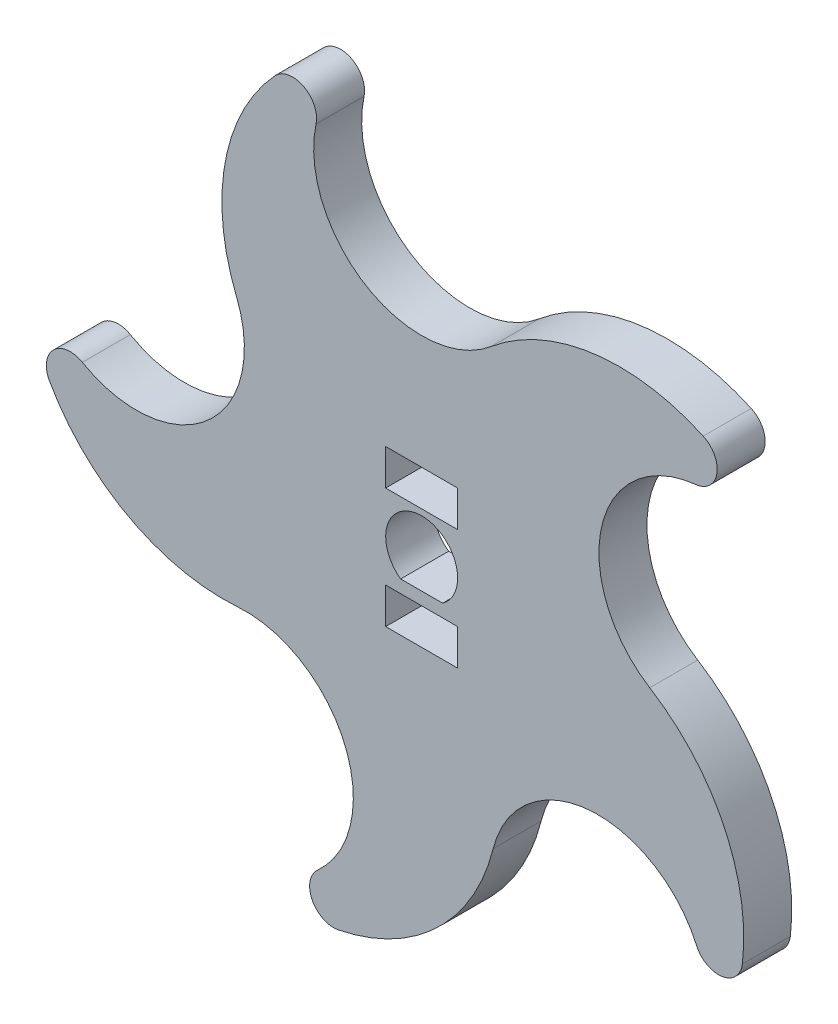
ISO-10303-21;
HEADER;
FILE_DESCRIPTION(('STEP AP214'),'2;1');
FILE_NAME('part.step','',(''),(''),'','','');
FILE_SCHEMA(('AUTOMOTIVE_DESIGN { 1 0 10303 214 1 1 1 1 }'));
ENDSEC;
DATA;
#1=APPLICATION_CONTEXT('core data for automotive mechanical design processes');
#2=APPLICATION_PROTOCOL_DEFINITION('international standard','automotive_design',2000,#1);
#3=PRODUCT_CONTEXT('',#1,'mechanical');
#4=PRODUCT('Part','Part','',(#3));
#5=PRODUCT_RELATED_PRODUCT_CATEGORY('part','',(#4));
#6=PRODUCT_DEFINITION_FORMATION('','',#4);
#7=PRODUCT_DEFINITION_CONTEXT('part definition',#1,'design');
#8=PRODUCT_DEFINITION('design','',#6,#7);
#9=PRODUCT_DEFINITION_SHAPE('','',#8);
#10=(LENGTH_UNIT() NAMED_UNIT(*) SI_UNIT(.MILLI.,.METRE.));
#11=(NAMED_UNIT(*) PLANE_ANGLE_UNIT() SI_UNIT($,.RADIAN.));
#12=(NAMED_UNIT(*) SI_UNIT($,.STERADIAN.) SOLID_ANGLE_UNIT());
#13=UNCERTAINTY_MEASURE_WITH_UNIT(LENGTH_MEASURE(1.E-05),#10,'distance_accuracy_value','');
#14=(GEOMETRIC_REPRESENTATION_CONTEXT(3) GLOBAL_UNCERTAINTY_ASSIGNED_CONTEXT((#13)) GLOBAL_UNIT_ASSIGNED_CONTEXT((#10,
#11,#12)) REPRESENTATION_CONTEXT('',''));
#15=CARTESIAN_POINT('',(0.,0.,0.));
#16=DIRECTION('',(0.,0.,1.));
#17=DIRECTION('',(1.,0.,0.));
#18=AXIS2_PLACEMENT_3D('',#15,#16,#17);
#19=CARTESIAN_POINT('',(-29.2829028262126,-1.79710467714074,4.));
#20=DIRECTION('',(0.,0.,-1.));
#21=DIRECTION('',(-1.,0.,0.));
#22=AXIS2_PLACEMENT_3D('',#19,#20,#21);
#23=CYLINDRICAL_SURFACE('',#22,2.);
#24=CARTESIAN_POINT('',(-29.2829028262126,-1.79710467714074,0.));
#25=DIRECTION('',(0.,0.,1.));
#26=DIRECTION('',(1.,0.,0.));
#27=AXIS2_PLACEMENT_3D('',#24,#25,#26);
#28=CIRCLE('',#27,2.);
#29=CARTESIAN_POINT('',(-28.28172284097,-0.0657356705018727,0.));
#30=VERTEX_POINT('',#29);
#31=CARTESIAN_POINT('',(-31.0278998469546,-2.77433822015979,0.));
#32=VERTEX_POINT('',#31);
#33=EDGE_CURVE('E257',#30,#32,#28,.T.);
#34=ORIENTED_EDGE('',*,*,#33,.T.);
#35=DIRECTION('',(0.,0.,-1.));
#36=VECTOR('',#35,1.);
#37=CARTESIAN_POINT('',(-31.0278998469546,-2.77433822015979,4.));
#38=LINE('',#37,#36);
#39=CARTESIAN_POINT('',(-31.0278998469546,-2.77433822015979,4.));
#40=VERTEX_POINT('',#39);
#41=EDGE_CURVE('E363',#40,#32,#38,.T.);
#42=ORIENTED_EDGE('',*,*,#41,.F.);
#43=CARTESIAN_POINT('',(-29.2829028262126,-1.79710467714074,4.));
#44=DIRECTION('',(0.,0.,1.));
#45=DIRECTION('',(1.,0.,0.));
#46=AXIS2_PLACEMENT_3D('',#43,#44,#45);
#47=CIRCLE('',#46,2.);
#48=CARTESIAN_POINT('',(-28.28172284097,-0.0657356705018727,4.));
#49=VERTEX_POINT('',#48);
#50=EDGE_CURVE('E260',#49,#40,#47,.T.);
#51=ORIENTED_EDGE('',*,*,#50,.F.);
#52=DIRECTION('',(0.,0.,-1.));
#53=VECTOR('',#52,1.);
#54=CARTESIAN_POINT('',(-28.28172284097,-0.0657356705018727,4.));
#55=LINE('',#54,#53);
#56=EDGE_CURVE('E292',#49,#30,#55,.T.);
#57=ORIENTED_EDGE('',*,*,#56,.T.);
#58=EDGE_LOOP('',(#34,#42,#51,#57));
#59=FACE_BOUND('',#58,.T.);
#60=ADVANCED_FACE('F32',(#59),#23,.T.);
#61=CARTESIAN_POINT('',(-16.5004563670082,5.36132327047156,4.));
#62=DIRECTION('',(0.,0.,-1.));
#63=DIRECTION('',(-1.,0.,0.));
#64=AXIS2_PLACEMENT_3D('',#61,#62,#63);
#65=CYLINDRICAL_SURFACE('',#64,16.6503934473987);
#66=CARTESIAN_POINT('',(-16.5004563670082,5.36132327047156,0.));
#67=DIRECTION('',(0.,0.,1.));
#68=DIRECTION('',(1.,0.,0.));
#69=AXIS2_PLACEMENT_3D('',#66,#67,#68);
#70=CIRCLE('',#69,16.6503934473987);
#71=CARTESIAN_POINT('',(-15.3282444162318,-11.2477562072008,0.));
#72=VERTEX_POINT('',#71);
#73=EDGE_CURVE('E295',#32,#72,#70,.T.);
#74=ORIENTED_EDGE('',*,*,#73,.T.);
#75=DIRECTION('',(0.,0.,-1.));
#76=VECTOR('',#75,1.);
#77=CARTESIAN_POINT('',(-15.3282444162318,-11.2477562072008,4.));
#78=LINE('',#77,#76);
#79=CARTESIAN_POINT('',(-15.3282444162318,-11.2477562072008,4.));
#80=VERTEX_POINT('',#79);
#81=EDGE_CURVE('E360',#80,#72,#78,.T.);
#82=ORIENTED_EDGE('',*,*,#81,.F.);
#83=CARTESIAN_POINT('',(-16.5004563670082,5.36132327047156,4.));
#84=DIRECTION('',(0.,0.,1.));
#85=DIRECTION('',(1.,0.,0.));
#86=AXIS2_PLACEMENT_3D('',#83,#84,#85);
#87=CIRCLE('',#86,16.6503934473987);
#88=EDGE_CURVE('E263',#40,#80,#87,.T.);
#89=ORIENTED_EDGE('',*,*,#88,.F.);
#90=ORIENTED_EDGE('',*,*,#41,.T.);
#91=EDGE_LOOP('',(#74,#82,#89,#90));
#92=FACE_BOUND('',#91,.T.);
#93=ADVANCED_FACE('F415',(#92),#65,.T.);
#94=CARTESIAN_POINT('',(-14.6946313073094,-20.2254248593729,4.));
#95=DIRECTION('',(0.,0.,-1.));
#96=DIRECTION('',(-1.,0.,0.));
#97=AXIS2_PLACEMENT_3D('',#94,#95,#96);
#98=CYLINDRICAL_SURFACE('',#97,8.99999999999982);
#99=CARTESIAN_POINT('',(-14.6946313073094,-20.2254248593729,0.));
#100=DIRECTION('',(0.,0.,-1.));
#101=DIRECTION('',(1.,0.,0.));
#102=AXIS2_PLACEMENT_3D('',#99,#100,#101);
#103=CIRCLE('',#102,8.99999999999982);
#104=CARTESIAN_POINT('',(-8.67701465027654,-26.9178302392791,0.));
#105=VERTEX_POINT('',#104);
#106=EDGE_CURVE('E297',#72,#105,#103,.T.);
#107=ORIENTED_EDGE('',*,*,#106,.T.);
#108=DIRECTION('',(0.,0.,-1.));
#109=VECTOR('',#108,1.);
#110=CARTESIAN_POINT('',(-8.67701465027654,-26.9178302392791,4.));
#111=LINE('',#110,#109);
#112=CARTESIAN_POINT('',(-8.67701465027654,-26.9178302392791,4.));
#113=VERTEX_POINT('',#112);
#114=EDGE_CURVE('E357',#113,#105,#111,.T.);
#115=ORIENTED_EDGE('',*,*,#114,.F.);
#116=CARTESIAN_POINT('',(-14.6946313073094,-20.2254248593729,4.));
#117=DIRECTION('',(0.,0.,-1.));
#118=DIRECTION('',(1.,0.,0.));
#119=AXIS2_PLACEMENT_3D('',#116,#117,#118);
#120=CIRCLE('',#119,8.99999999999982);
#121=EDGE_CURVE('E266',#80,#113,#120,.T.);
#122=ORIENTED_EDGE('',*,*,#121,.F.);
#123=ORIENTED_EDGE('',*,*,#81,.T.);
#124=EDGE_LOOP('',(#107,#115,#122,#123));
#125=FACE_BOUND('',#124,.T.);
#126=ADVANCED_FACE('F420',(#125),#98,.F.);
#127=CARTESIAN_POINT('',(-7.33976650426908,-28.405031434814,4.));
#128=DIRECTION('',(0.,0.,-1.));
#129=DIRECTION('',(-1.,0.,0.));
#130=AXIS2_PLACEMENT_3D('',#127,#128,#129);
#131=CYLINDRICAL_SURFACE('',#130,2.);
#132=CARTESIAN_POINT('',(-7.33976650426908,-28.405031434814,0.));
#133=DIRECTION('',(0.,0.,1.));
#134=DIRECTION('',(1.,0.,0.));
#135=AXIS2_PLACEMENT_3D('',#132,#133,#134);
#136=CIRCLE('',#135,2.);
#137=CARTESIAN_POINT('',(-6.94959590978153,-30.3666039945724,0.));
#138=VERTEX_POINT('',#137);
#139=EDGE_CURVE('E299',#105,#138,#136,.T.);
#140=ORIENTED_EDGE('',*,*,#139,.T.);
#141=DIRECTION('',(0.,0.,-1.));
#142=VECTOR('',#141,1.);
#143=CARTESIAN_POINT('',(-6.94959590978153,-30.3666039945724,4.));
#144=LINE('',#143,#142);
#145=CARTESIAN_POINT('',(-6.94959590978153,-30.3666039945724,4.));
#146=VERTEX_POINT('',#145);
#147=EDGE_CURVE('E354',#146,#138,#144,.T.);
#148=ORIENTED_EDGE('',*,*,#147,.F.);
#149=CARTESIAN_POINT('',(-7.33976650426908,-28.405031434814,4.));
#150=DIRECTION('',(0.,0.,1.));
#151=DIRECTION('',(1.,0.,0.));
#152=AXIS2_PLACEMENT_3D('',#149,#150,#151);
#153=CIRCLE('',#152,2.);
#154=EDGE_CURVE('E268',#113,#146,#153,.T.);
#155=ORIENTED_EDGE('',*,*,#154,.F.);
#156=ORIENTED_EDGE('',*,*,#114,.T.);
#157=EDGE_LOOP('',(#140,#148,#155,#156));
#158=FACE_BOUND('',#157,.T.);
#159=ADVANCED_FACE('F488',(#158),#131,.T.);
#160=CARTESIAN_POINT('',(-10.1978428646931,-14.0361265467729,4.));
#161=DIRECTION('',(0.,0.,-1.));
#162=DIRECTION('',(-1.,0.,0.));
#163=AXIS2_PLACEMENT_3D('',#160,#161,#162);
#164=CYLINDRICAL_SURFACE('',#163,16.6503934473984);
#165=CARTESIAN_POINT('',(-10.1978428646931,-14.0361265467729,0.));
#166=DIRECTION('',(0.,0.,1.));
#167=DIRECTION('',(1.,0.,0.));
#168=AXIS2_PLACEMENT_3D('',#165,#166,#167);
#169=CIRCLE('',#168,16.6503934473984);
#170=CARTESIAN_POINT('',(5.96056381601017,-18.0537745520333,0.));
#171=VERTEX_POINT('',#170);
#172=EDGE_CURVE('E301',#138,#171,#169,.T.);
#173=ORIENTED_EDGE('',*,*,#172,.T.);
#174=DIRECTION('',(0.,0.,-1.));
#175=VECTOR('',#174,1.);
#176=CARTESIAN_POINT('',(5.96056381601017,-18.0537745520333,4.));
#177=LINE('',#176,#175);
#178=CARTESIAN_POINT('',(5.96056381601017,-18.0537745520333,4.));
#179=VERTEX_POINT('',#178);
#180=EDGE_CURVE('E351',#179,#171,#177,.T.);
#181=ORIENTED_EDGE('',*,*,#180,.F.);
#182=CARTESIAN_POINT('',(-10.1978428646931,-14.0361265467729,4.));
#183=DIRECTION('',(0.,0.,1.));
#184=DIRECTION('',(1.,0.,0.));
#185=AXIS2_PLACEMENT_3D('',#182,#183,#184);
#186=CIRCLE('',#185,16.6503934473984);
#187=EDGE_CURVE('E270',#146,#179,#186,.T.);
#188=ORIENTED_EDGE('',*,*,#187,.F.);
#189=ORIENTED_EDGE('',*,*,#147,.T.);
#190=EDGE_LOOP('',(#173,#181,#188,#189));
#191=FACE_BOUND('',#190,.T.);
#192=ADVANCED_FACE('F485',(#191),#164,.T.);
#193=CARTESIAN_POINT('',(14.6946313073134,-20.2254248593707,4.));
#194=DIRECTION('',(0.,0.,-1.));
#195=DIRECTION('',(-1.,0.,0.));
#196=AXIS2_PLACEMENT_3D('',#193,#194,#195);
#197=CYLINDRICAL_SURFACE('',#196,9.00000000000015);
#198=CARTESIAN_POINT('',(14.6946313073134,-20.2254248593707,0.));
#199=DIRECTION('',(0.,0.,-1.));
#200=DIRECTION('',(1.,0.,0.));
#201=AXIS2_PLACEMENT_3D('',#198,#199,#200);
#202=CIRCLE('',#201,9.00000000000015);
#203=CARTESIAN_POINT('',(22.9190328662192,-16.5703983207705,0.));
#204=VERTEX_POINT('',#203);
#205=EDGE_CURVE('E303',#171,#204,#202,.T.);
#206=ORIENTED_EDGE('',*,*,#205,.T.);
#207=DIRECTION('',(0.,0.,-1.));
#208=VECTOR('',#207,1.);
#209=CARTESIAN_POINT('',(22.9190328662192,-16.5703983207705,4.));
#210=LINE('',#209,#208);
#211=CARTESIAN_POINT('',(22.9190328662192,-16.5703983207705,4.));
#212=VERTEX_POINT('',#211);
#213=EDGE_CURVE('E348',#212,#204,#210,.T.);
#214=ORIENTED_EDGE('',*,*,#213,.F.);
#215=CARTESIAN_POINT('',(14.6946313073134,-20.2254248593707,4.));
#216=DIRECTION('',(0.,0.,-1.));
#217=DIRECTION('',(1.,0.,0.));
#218=AXIS2_PLACEMENT_3D('',#215,#216,#217);
#219=CIRCLE('',#218,9.00000000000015);
#220=EDGE_CURVE('E272',#179,#212,#219,.T.);
#221=ORIENTED_EDGE('',*,*,#220,.F.);
#222=ORIENTED_EDGE('',*,*,#180,.T.);
#223=EDGE_LOOP('',(#206,#214,#221,#222));
#224=FACE_BOUND('',#223,.T.);
#225=ADVANCED_FACE('F481',(#224),#197,.F.);
#226=CARTESIAN_POINT('',(24.7466776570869,-15.7581702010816,4.));
#227=DIRECTION('',(0.,0.,-1.));
#228=DIRECTION('',(-1.,0.,0.));
#229=AXIS2_PLACEMENT_3D('',#226,#227,#228);
#230=CYLINDRICAL_SURFACE('',#229,2.);
#231=CARTESIAN_POINT('',(24.7466776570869,-15.7581702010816,0.));
#232=DIRECTION('',(0.,0.,1.));
#233=DIRECTION('',(1.,0.,0.));
#234=AXIS2_PLACEMENT_3D('',#231,#232,#233);
#235=CIRCLE('',#234,2.);
#236=CARTESIAN_POINT('',(26.732813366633,-15.9932551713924,0.));
#237=VERTEX_POINT('',#236);
#238=EDGE_CURVE('E305',#204,#237,#235,.T.);
#239=ORIENTED_EDGE('',*,*,#238,.T.);
#240=DIRECTION('',(0.,0.,-1.));
#241=VECTOR('',#240,1.);
#242=CARTESIAN_POINT('',(26.732813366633,-15.9932551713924,4.));
#243=LINE('',#242,#241);
#244=CARTESIAN_POINT('',(26.732813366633,-15.9932551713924,4.));
#245=VERTEX_POINT('',#244);
#246=EDGE_CURVE('E345',#245,#237,#243,.T.);
#247=ORIENTED_EDGE('',*,*,#246,.F.);
#248=CARTESIAN_POINT('',(24.7466776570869,-15.7581702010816,4.));
#249=DIRECTION('',(0.,0.,1.));
#250=DIRECTION('',(1.,0.,0.));
#251=AXIS2_PLACEMENT_3D('',#248,#249,#250);
#252=CIRCLE('',#251,2.);
#253=EDGE_CURVE('E274',#212,#245,#252,.T.);
#254=ORIENTED_EDGE('',*,*,#253,.F.);
#255=ORIENTED_EDGE('',*,*,#213,.T.);
#256=EDGE_LOOP('',(#239,#247,#254,#255));
#257=FACE_BOUND('',#256,.T.);
#258=ADVANCED_FACE('F476',(#257),#230,.T.);
#259=CARTESIAN_POINT('',(10.1978428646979,-14.0361265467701,4.));
#260=DIRECTION('',(0.,0.,-1.));
#261=DIRECTION('',(-1.,0.,0.));
#262=AXIS2_PLACEMENT_3D('',#259,#260,#261);
#263=CYLINDRICAL_SURFACE('',#262,16.6503934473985);
#264=CARTESIAN_POINT('',(10.1978428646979,-14.0361265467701,0.));
#265=DIRECTION('',(0.,0.,1.));
#266=DIRECTION('',(1.,0.,0.));
#267=AXIS2_PLACEMENT_3D('',#264,#265,#266);
#268=CIRCLE('',#267,16.6503934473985);
#269=CARTESIAN_POINT('',(19.0120754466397,0.0899099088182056,0.));
#270=VERTEX_POINT('',#269);
#271=EDGE_CURVE('E307',#237,#270,#268,.T.);
#272=ORIENTED_EDGE('',*,*,#271,.T.);
#273=DIRECTION('',(0.,0.,-1.));
#274=VECTOR('',#273,1.);
#275=CARTESIAN_POINT('',(19.0120754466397,0.0899099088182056,4.));
#276=LINE('',#275,#274);
#277=CARTESIAN_POINT('',(19.0120754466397,0.0899099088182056,4.));
#278=VERTEX_POINT('',#277);
#279=EDGE_CURVE('E342',#278,#270,#276,.T.);
#280=ORIENTED_EDGE('',*,*,#279,.F.);
#281=CARTESIAN_POINT('',(10.1978428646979,-14.0361265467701,4.));
#282=DIRECTION('',(0.,0.,1.));
#283=DIRECTION('',(1.,0.,0.));
#284=AXIS2_PLACEMENT_3D('',#281,#282,#283);
#285=CIRCLE('',#284,16.6503934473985);
#286=EDGE_CURVE('E276',#245,#278,#285,.T.);
#287=ORIENTED_EDGE('',*,*,#286,.F.);
#288=ORIENTED_EDGE('',*,*,#246,.T.);
#289=EDGE_LOOP('',(#272,#280,#287,#288));
#290=FACE_BOUND('',#289,.T.);
#291=ADVANCED_FACE('F470',(#290),#263,.T.);
#292=CARTESIAN_POINT('',(23.7764129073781,7.72542485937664,4.));
#293=DIRECTION('',(0.,0.,-1.));
#294=DIRECTION('',(-1.,0.,0.));
#295=AXIS2_PLACEMENT_3D('',#292,#293,#294);
#296=CYLINDRICAL_SURFACE('',#295,9.);
#297=CARTESIAN_POINT('',(23.7764129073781,7.72542485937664,0.));
#298=DIRECTION('',(0.,0.,-1.));
#299=DIRECTION('',(1.,0.,0.));
#300=AXIS2_PLACEMENT_3D('',#297,#298,#299);
#301=CIRCLE('',#300,9.);
#302=CARTESIAN_POINT('',(22.8417559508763,16.6767608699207,0.));
#303=VERTEX_POINT('',#302);
#304=EDGE_CURVE('E309',#270,#303,#301,.T.);
#305=ORIENTED_EDGE('',*,*,#304,.T.);
#306=DIRECTION('',(0.,0.,-1.));
#307=VECTOR('',#306,1.);
#308=CARTESIAN_POINT('',(22.8417559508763,16.6767608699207,4.));
#309=LINE('',#308,#307);
#310=CARTESIAN_POINT('',(22.8417559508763,16.6767608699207,4.));
#311=VERTEX_POINT('',#310);
#312=EDGE_CURVE('E339',#311,#303,#309,.T.);
#313=ORIENTED_EDGE('',*,*,#312,.F.);
#314=CARTESIAN_POINT('',(23.7764129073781,7.72542485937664,4.));
#315=DIRECTION('',(0.,0.,-1.));
#316=DIRECTION('',(1.,0.,0.));
#317=AXIS2_PLACEMENT_3D('',#314,#315,#316);
#318=CIRCLE('',#317,9.);
#319=EDGE_CURVE('E278',#278,#311,#318,.T.);
#320=ORIENTED_EDGE('',*,*,#319,.F.);
#321=ORIENTED_EDGE('',*,*,#279,.T.);
#322=EDGE_LOOP('',(#305,#313,#320,#321));
#323=FACE_BOUND('',#322,.T.);
#324=ADVANCED_FACE('F466',(#323),#296,.F.);
#325=CARTESIAN_POINT('',(22.634054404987,18.6659466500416,4.));
#326=DIRECTION('',(0.,0.,-1.));
#327=DIRECTION('',(-1.,0.,0.));
#328=AXIS2_PLACEMENT_3D('',#325,#326,#327);
#329=CYLINDRICAL_SURFACE('',#328,2.);
#330=CARTESIAN_POINT('',(22.634054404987,18.6659466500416,0.));
#331=DIRECTION('',(0.,0.,1.));
#332=DIRECTION('',(1.,0.,0.));
#333=AXIS2_PLACEMENT_3D('',#330,#331,#332);
#334=CIRCLE('',#333,2.);
#335=CARTESIAN_POINT('',(23.4713831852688,20.4822287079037,0.));
#336=VERTEX_POINT('',#335);
#337=EDGE_CURVE('E311',#303,#336,#334,.T.);
#338=ORIENTED_EDGE('',*,*,#337,.T.);
#339=DIRECTION('',(0.,0.,-1.));
#340=VECTOR('',#339,1.);
#341=CARTESIAN_POINT('',(23.4713831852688,20.4822287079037,4.));
#342=LINE('',#341,#340);
#343=CARTESIAN_POINT('',(23.4713831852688,20.4822287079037,4.));
#344=VERTEX_POINT('',#343);
#345=EDGE_CURVE('E336',#344,#336,#342,.T.);
#346=ORIENTED_EDGE('',*,*,#345,.F.);
#347=CARTESIAN_POINT('',(22.634054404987,18.6659466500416,4.));
#348=DIRECTION('',(0.,0.,1.));
#349=DIRECTION('',(1.,0.,0.));
#350=AXIS2_PLACEMENT_3D('',#347,#348,#349);
#351=CIRCLE('',#350,2.);
#352=EDGE_CURVE('E280',#311,#344,#351,.T.);
#353=ORIENTED_EDGE('',*,*,#352,.F.);
#354=ORIENTED_EDGE('',*,*,#312,.T.);
#355=EDGE_LOOP('',(#338,#346,#353,#354));
#356=FACE_BOUND('',#355,.T.);
#357=ADVANCED_FACE('F461',(#356),#329,.T.);
#358=CARTESIAN_POINT('',(16.5004563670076,5.3613232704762,4.));
#359=DIRECTION('',(0.,0.,-1.));
#360=DIRECTION('',(-1.,0.,0.));
#361=AXIS2_PLACEMENT_3D('',#358,#359,#360);
#362=CYLINDRICAL_SURFACE('',#361,16.6503934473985);
#363=CARTESIAN_POINT('',(16.5004563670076,5.3613232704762,0.));
#364=DIRECTION('',(0.,0.,1.));
#365=DIRECTION('',(1.,0.,0.));
#366=AXIS2_PLACEMENT_3D('',#363,#364,#365);
#367=CIRCLE('',#366,16.6503934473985);
#368=CARTESIAN_POINT('',(5.78954500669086,18.1093419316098,0.));
#369=VERTEX_POINT('',#368);
#370=EDGE_CURVE('E313',#336,#369,#367,.T.);
#371=ORIENTED_EDGE('',*,*,#370,.T.);
#372=DIRECTION('',(0.,0.,-1.));
#373=VECTOR('',#372,1.);
#374=CARTESIAN_POINT('',(5.78954500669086,18.1093419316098,4.));
#375=LINE('',#374,#373);
#376=CARTESIAN_POINT('',(5.78954500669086,18.1093419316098,4.));
#377=VERTEX_POINT('',#376);
#378=EDGE_CURVE('E333',#377,#369,#375,.T.);
#379=ORIENTED_EDGE('',*,*,#378,.F.);
#380=CARTESIAN_POINT('',(16.5004563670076,5.3613232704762,4.));
#381=DIRECTION('',(0.,0.,1.));
#382=DIRECTION('',(1.,0.,0.));
#383=AXIS2_PLACEMENT_3D('',#380,#381,#382);
#384=CIRCLE('',#383,16.6503934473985);
#385=EDGE_CURVE('E282',#344,#377,#384,.T.);
#386=ORIENTED_EDGE('',*,*,#385,.F.);
#387=ORIENTED_EDGE('',*,*,#345,.T.);
#388=EDGE_LOOP('',(#371,#379,#386,#387));
#389=FACE_BOUND('',#388,.T.);
#390=ADVANCED_FACE('F455',(#389),#362,.T.);
#391=CARTESIAN_POINT('',(-1.46100916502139E-12,25.0000000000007,4.));
#392=DIRECTION('',(0.,0.,-1.));
#393=DIRECTION('',(-1.,0.,0.));
#394=AXIS2_PLACEMENT_3D('',#391,#392,#393);
#395=CYLINDRICAL_SURFACE('',#394,8.99999999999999);
#396=CARTESIAN_POINT('',(-1.46100916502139E-12,25.0000000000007,0.));
#397=DIRECTION('',(0.,0.,-1.));
#398=DIRECTION('',(1.,0.,0.));
#399=AXIS2_PLACEMENT_3D('',#396,#397,#398);
#400=CIRCLE('',#399,8.99999999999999);
#401=CARTESIAN_POINT('',(-8.80205132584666,26.8772033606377,0.));
#402=VERTEX_POINT('',#401);
#403=EDGE_CURVE('E315',#369,#402,#400,.T.);
#404=ORIENTED_EDGE('',*,*,#403,.T.);
#405=DIRECTION('',(0.,0.,-1.));
#406=VECTOR('',#405,1.);
#407=CARTESIAN_POINT('',(-8.80205132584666,26.8772033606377,4.));
#408=LINE('',#407,#406);
#409=CARTESIAN_POINT('',(-8.80205132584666,26.8772033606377,4.));
#410=VERTEX_POINT('',#409);
#411=EDGE_CURVE('E330',#410,#402,#408,.T.);
#412=ORIENTED_EDGE('',*,*,#411,.F.);
#413=CARTESIAN_POINT('',(-1.46100916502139E-12,25.0000000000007,4.));
#414=DIRECTION('',(0.,0.,-1.));
#415=DIRECTION('',(1.,0.,0.));
#416=AXIS2_PLACEMENT_3D('',#413,#414,#415);
#417=CIRCLE('',#416,8.99999999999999);
#418=EDGE_CURVE('E284',#377,#410,#417,.T.);
#419=ORIENTED_EDGE('',*,*,#418,.F.);
#420=ORIENTED_EDGE('',*,*,#378,.T.);
#421=EDGE_LOOP('',(#404,#412,#419,#420));
#422=FACE_BOUND('',#421,.T.);
#423=ADVANCED_FACE('F451',(#422),#395,.F.);
#424=CARTESIAN_POINT('',(-10.75806273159,27.2943596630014,4.));
#425=DIRECTION('',(0.,0.,-1.));
#426=DIRECTION('',(-1.,0.,0.));
#427=AXIS2_PLACEMENT_3D('',#424,#425,#426);
#428=CYLINDRICAL_SURFACE('',#427,2.);
#429=CARTESIAN_POINT('',(-10.75806273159,27.2943596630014,0.));
#430=DIRECTION('',(0.,0.,1.));
#431=DIRECTION('',(1.,0.,0.));
#432=AXIS2_PLACEMENT_3D('',#429,#430,#431);
#433=CIRCLE('',#432,2.);
#434=CARTESIAN_POINT('',(-12.2267007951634,28.6519686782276,0.));
#435=VERTEX_POINT('',#434);
#436=EDGE_CURVE('E317',#402,#435,#433,.T.);
#437=ORIENTED_EDGE('',*,*,#436,.T.);
#438=DIRECTION('',(0.,0.,-1.));
#439=VECTOR('',#438,1.);
#440=CARTESIAN_POINT('',(-12.2267007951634,28.6519686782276,4.));
#441=LINE('',#440,#439);
#442=CARTESIAN_POINT('',(-12.2267007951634,28.6519686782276,4.));
#443=VERTEX_POINT('',#442);
#444=EDGE_CURVE('E327',#443,#435,#441,.T.);
#445=ORIENTED_EDGE('',*,*,#444,.F.);
#446=CARTESIAN_POINT('',(-10.75806273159,27.2943596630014,4.));
#447=DIRECTION('',(0.,0.,1.));
#448=DIRECTION('',(1.,0.,0.));
#449=AXIS2_PLACEMENT_3D('',#446,#447,#448);
#450=CIRCLE('',#449,2.);
#451=EDGE_CURVE('E286',#410,#443,#450,.T.);
#452=ORIENTED_EDGE('',*,*,#451,.F.);
#453=ORIENTED_EDGE('',*,*,#411,.T.);
#454=EDGE_LOOP('',(#437,#445,#452,#453));
#455=FACE_BOUND('',#454,.T.);
#456=ADVANCED_FACE('F446',(#455),#428,.T.);
#457=CARTESIAN_POINT('',(-1.99075572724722E-12,17.349606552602,4.));
#458=DIRECTION('',(0.,0.,-1.));
#459=DIRECTION('',(-1.,0.,0.));
#460=AXIS2_PLACEMENT_3D('',#457,#458,#459);
#461=CYLINDRICAL_SURFACE('',#460,16.6503934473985);
#462=CARTESIAN_POINT('',(-1.99075572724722E-12,17.349606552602,0.));
#463=DIRECTION('',(0.,0.,1.));
#464=DIRECTION('',(1.,0.,0.));
#465=AXIS2_PLACEMENT_3D('',#462,#463,#464);
#466=CIRCLE('',#465,16.6503934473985);
#467=CARTESIAN_POINT('',(-15.4339398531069,11.1022789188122,0.));
#468=VERTEX_POINT('',#467);
#469=EDGE_CURVE('E319',#435,#468,#466,.T.);
#470=ORIENTED_EDGE('',*,*,#469,.T.);
#471=DIRECTION('',(0.,0.,-1.));
#472=VECTOR('',#471,1.);
#473=CARTESIAN_POINT('',(-15.4339398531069,11.1022789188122,4.));
#474=LINE('',#473,#472);
#475=CARTESIAN_POINT('',(-15.4339398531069,11.1022789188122,4.));
#476=VERTEX_POINT('',#475);
#477=EDGE_CURVE('E324',#476,#468,#474,.T.);
#478=ORIENTED_EDGE('',*,*,#477,.F.);
#479=CARTESIAN_POINT('',(-1.99075572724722E-12,17.349606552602,4.));
#480=DIRECTION('',(0.,0.,1.));
#481=DIRECTION('',(1.,0.,0.));
#482=AXIS2_PLACEMENT_3D('',#479,#480,#481);
#483=CIRCLE('',#482,16.6503934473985);
#484=EDGE_CURVE('E288',#443,#476,#483,.T.);
#485=ORIENTED_EDGE('',*,*,#484,.F.);
#486=ORIENTED_EDGE('',*,*,#444,.T.);
#487=EDGE_LOOP('',(#470,#478,#485,#486));
#488=FACE_BOUND('',#487,.T.);
#489=ADVANCED_FACE('F440',(#488),#461,.T.);
#490=CARTESIAN_POINT('',(-23.7764129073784,7.72542485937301,4.));
#491=DIRECTION('',(0.,0.,-1.));
#492=DIRECTION('',(-1.,0.,0.));
#493=AXIS2_PLACEMENT_3D('',#490,#491,#492);
#494=CYLINDRICAL_SURFACE('',#493,9.);
#495=CARTESIAN_POINT('',(-23.7764129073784,7.72542485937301,0.));
#496=DIRECTION('',(0.,0.,-1.));
#497=DIRECTION('',(1.,0.,0.));
#498=AXIS2_PLACEMENT_3D('',#495,#496,#497);
#499=CIRCLE('',#498,9.);
#500=EDGE_CURVE('E264',#468,#30,#499,.T.);
#501=ORIENTED_EDGE('',*,*,#500,.T.);
#502=ORIENTED_EDGE('',*,*,#56,.F.);
#503=CARTESIAN_POINT('',(-23.7764129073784,7.72542485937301,4.));
#504=DIRECTION('',(0.,0.,-1.));
#505=DIRECTION('',(1.,0.,0.));
#506=AXIS2_PLACEMENT_3D('',#503,#504,#505);
#507=CIRCLE('',#506,9.);
#508=EDGE_CURVE('E290',#476,#49,#507,.T.);
#509=ORIENTED_EDGE('',*,*,#508,.F.);
#510=ORIENTED_EDGE('',*,*,#477,.T.);
#511=EDGE_LOOP('',(#501,#502,#509,#510));
#512=FACE_BOUND('',#511,.T.);
#513=ADVANCED_FACE('F438',(#512),#494,.F.);
#514=CARTESIAN_POINT('',(-22.8916795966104,1.78210929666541,4.));
#515=DIRECTION('',(0.,0.,1.));
#516=DIRECTION('',(1.,0.,0.));
#517=AXIS2_PLACEMENT_3D('',#514,#515,#516);
#518=PLANE('',#517);
#519=DIRECTION('',(0.,1.,0.));
#520=VECTOR('',#519,1.);
#521=CARTESIAN_POINT('',(3.,-6.5,4.));
#522=LINE('',#521,#520);
#523=CARTESIAN_POINT('',(3.,-6.5,4.));
#524=VERTEX_POINT('',#523);
#525=CARTESIAN_POINT('',(3.,-3.5,4.));
#526=VERTEX_POINT('',#525);
#527=EDGE_CURVE('E46',#524,#526,#522,.T.);
#528=ORIENTED_EDGE('',*,*,#527,.F.);
#529=DIRECTION('',(1.,0.,0.));
#530=VECTOR('',#529,1.);
#531=CARTESIAN_POINT('',(-3.,-6.5,4.));
#532=LINE('',#531,#530);
#533=CARTESIAN_POINT('',(-3.,-6.5,4.));
#534=VERTEX_POINT('',#533);
#535=EDGE_CURVE('E239',#534,#524,#532,.T.);
#536=ORIENTED_EDGE('',*,*,#535,.F.);
#537=DIRECTION('',(0.,-1.,0.));
#538=VECTOR('',#537,1.);
#539=CARTESIAN_POINT('',(-3.,-3.5,4.));
#540=LINE('',#539,#538);
#541=CARTESIAN_POINT('',(-3.,-3.5,4.));
#542=VERTEX_POINT('',#541);
#543=EDGE_CURVE('E236',#542,#534,#540,.T.);
#544=ORIENTED_EDGE('',*,*,#543,.F.);
#545=DIRECTION('',(-1.,0.,0.));
#546=VECTOR('',#545,1.);
#547=CARTESIAN_POINT('',(3.,-3.5,4.));
#548=LINE('',#547,#546);
#549=EDGE_CURVE('E233',#526,#542,#548,.T.);
#550=ORIENTED_EDGE('',*,*,#549,.F.);
#551=EDGE_LOOP('',(#528,#536,#544,#550));
#552=FACE_BOUND('',#551,.T.);
#553=DIRECTION('',(0.,1.,0.));
#554=VECTOR('',#553,1.);
#555=CARTESIAN_POINT('',(3.,6.5,4.));
#556=LINE('',#555,#554);
#557=CARTESIAN_POINT('',(3.,3.5,4.));
#558=VERTEX_POINT('',#557);
#559=CARTESIAN_POINT('',(3.,6.5,4.));
#560=VERTEX_POINT('',#559);
#561=EDGE_CURVE('E54',#558,#560,#556,.T.);
#562=ORIENTED_EDGE('',*,*,#561,.F.);
#563=DIRECTION('',(1.,0.,0.));
#564=VECTOR('',#563,1.);
#565=CARTESIAN_POINT('',(3.,3.5,4.));
#566=LINE('',#565,#564);
#567=CARTESIAN_POINT('',(-3.,3.5,4.));
#568=VERTEX_POINT('',#567);
#569=EDGE_CURVE('E222',#568,#558,#566,.T.);
#570=ORIENTED_EDGE('',*,*,#569,.F.);
#571=DIRECTION('',(0.,-1.,0.));
#572=VECTOR('',#571,1.);
#573=CARTESIAN_POINT('',(-3.,3.5,4.));
#574=LINE('',#573,#572);
#575=CARTESIAN_POINT('',(-3.,6.5,4.));
#576=VERTEX_POINT('',#575);
#577=EDGE_CURVE('E205',#576,#568,#574,.T.);
#578=ORIENTED_EDGE('',*,*,#577,.F.);
#579=DIRECTION('',(-1.,0.,0.));
#580=VECTOR('',#579,1.);
#581=CARTESIAN_POINT('',(-3.,6.5,4.));
#582=LINE('',#581,#580);
#583=EDGE_CURVE('E215',#560,#576,#582,.T.);
#584=ORIENTED_EDGE('',*,*,#583,.F.);
#585=EDGE_LOOP('',(#562,#570,#578,#584));
#586=FACE_BOUND('',#585,.T.);
#587=CARTESIAN_POINT('',(0.,0.,4.));
#588=DIRECTION('',(0.,0.,1.));
#589=DIRECTION('',(1.,0.,0.));
#590=AXIS2_PLACEMENT_3D('',#587,#588,#589);
#591=CIRCLE('',#590,3.);
#592=CARTESIAN_POINT('',(1.75,-2.43669858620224,4.));
#593=VERTEX_POINT('',#592);
#594=CARTESIAN_POINT('',(-1.75,-2.43669858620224,4.));
#595=VERTEX_POINT('',#594);
#596=EDGE_CURVE('E229',#593,#595,#591,.T.);
#597=ORIENTED_EDGE('',*,*,#596,.F.);
#598=DIRECTION('',(1.,0.,0.));
#599=VECTOR('',#598,1.);
#600=CARTESIAN_POINT('',(1.75,-2.43669858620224,4.));
#601=LINE('',#600,#599);
#602=EDGE_CURVE('E251',#595,#593,#601,.T.);
#603=ORIENTED_EDGE('',*,*,#602,.F.);
#604=EDGE_LOOP('',(#597,#603));
#605=FACE_BOUND('',#604,.T.);
#606=ORIENTED_EDGE('',*,*,#50,.T.);
#607=ORIENTED_EDGE('',*,*,#88,.T.);
#608=ORIENTED_EDGE('',*,*,#121,.T.);
#609=ORIENTED_EDGE('',*,*,#154,.T.);
#610=ORIENTED_EDGE('',*,*,#187,.T.);
#611=ORIENTED_EDGE('',*,*,#220,.T.);
#612=ORIENTED_EDGE('',*,*,#253,.T.);
#613=ORIENTED_EDGE('',*,*,#286,.T.);
#614=ORIENTED_EDGE('',*,*,#319,.T.);
#615=ORIENTED_EDGE('',*,*,#352,.T.);
#616=ORIENTED_EDGE('',*,*,#385,.T.);
#617=ORIENTED_EDGE('',*,*,#418,.T.);
#618=ORIENTED_EDGE('',*,*,#451,.T.);
#619=ORIENTED_EDGE('',*,*,#484,.T.);
#620=ORIENTED_EDGE('',*,*,#508,.T.);
#621=EDGE_LOOP('',(#606,#607,#608,#609,#610,#611,#612,#613,#614,#615,#616,#617,#618,#619,#620));
#622=FACE_BOUND('',#621,.T.);
#623=ADVANCED_FACE('F219',(#552,#586,#605,#622),#518,.T.);
#624=CARTESIAN_POINT('',(-22.8916795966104,1.78210929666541,0.));
#625=DIRECTION('',(0.,0.,1.));
#626=DIRECTION('',(1.,0.,0.));
#627=AXIS2_PLACEMENT_3D('',#624,#625,#626);
#628=PLANE('',#627);
#629=DIRECTION('',(1.,0.,0.));
#630=VECTOR('',#629,1.);
#631=CARTESIAN_POINT('',(-22.8916795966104,-6.5,0.));
#632=LINE('',#631,#630);
#633=CARTESIAN_POINT('',(-3.,-6.5,0.));
#634=VERTEX_POINT('',#633);
#635=CARTESIAN_POINT('',(3.,-6.5,0.));
#636=VERTEX_POINT('',#635);
#637=EDGE_CURVE('E39',#634,#636,#632,.T.);
#638=ORIENTED_EDGE('',*,*,#637,.T.);
#639=DIRECTION('',(0.,1.,0.));
#640=VECTOR('',#639,1.);
#641=CARTESIAN_POINT('',(3.,1.78210929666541,0.));
#642=LINE('',#641,#640);
#643=CARTESIAN_POINT('',(3.,-3.5,0.));
#644=VERTEX_POINT('',#643);
#645=EDGE_CURVE('E11',#636,#644,#642,.T.);
#646=ORIENTED_EDGE('',*,*,#645,.T.);
#647=DIRECTION('',(-1.,0.,0.));
#648=VECTOR('',#647,1.);
#649=CARTESIAN_POINT('',(-22.8916795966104,-3.5,0.));
#650=LINE('',#649,#648);
#651=CARTESIAN_POINT('',(-3.,-3.5,0.));
#652=VERTEX_POINT('',#651);
#653=EDGE_CURVE('E381',#644,#652,#650,.T.);
#654=ORIENTED_EDGE('',*,*,#653,.T.);
#655=DIRECTION('',(0.,-1.,0.));
#656=VECTOR('',#655,1.);
#657=CARTESIAN_POINT('',(-3.,1.7821092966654,0.));
#658=LINE('',#657,#656);
#659=EDGE_CURVE('E384',#652,#634,#658,.T.);
#660=ORIENTED_EDGE('',*,*,#659,.T.);
#661=EDGE_LOOP('',(#638,#646,#654,#660));
#662=FACE_BOUND('',#661,.T.);
#663=DIRECTION('',(1.,0.,0.));
#664=VECTOR('',#663,1.);
#665=CARTESIAN_POINT('',(-22.8916795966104,3.5,0.));
#666=LINE('',#665,#664);
#667=CARTESIAN_POINT('',(-3.,3.5,0.));
#668=VERTEX_POINT('',#667);
#669=CARTESIAN_POINT('',(3.,3.5,0.));
#670=VERTEX_POINT('',#669);
#671=EDGE_CURVE('E375',#668,#670,#666,.T.);
#672=ORIENTED_EDGE('',*,*,#671,.T.);
#673=DIRECTION('',(0.,1.,0.));
#674=VECTOR('',#673,1.);
#675=CARTESIAN_POINT('',(3.,1.78210929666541,0.));
#676=LINE('',#675,#674);
#677=CARTESIAN_POINT('',(3.,6.5,0.));
#678=VERTEX_POINT('',#677);
#679=EDGE_CURVE('E378',#670,#678,#676,.T.);
#680=ORIENTED_EDGE('',*,*,#679,.T.);
#681=DIRECTION('',(-1.,0.,0.));
#682=VECTOR('',#681,1.);
#683=CARTESIAN_POINT('',(-22.8916795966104,6.5,0.));
#684=LINE('',#683,#682);
#685=CARTESIAN_POINT('',(-3.,6.5,0.));
#686=VERTEX_POINT('',#685);
#687=EDGE_CURVE('E372',#678,#686,#684,.T.);
#688=ORIENTED_EDGE('',*,*,#687,.T.);
#689=DIRECTION('',(0.,-1.,0.));
#690=VECTOR('',#689,1.);
#691=CARTESIAN_POINT('',(-3.,1.78210929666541,0.));
#692=LINE('',#691,#690);
#693=EDGE_CURVE('E208',#686,#668,#692,.T.);
#694=ORIENTED_EDGE('',*,*,#693,.T.);
#695=EDGE_LOOP('',(#672,#680,#688,#694));
#696=FACE_BOUND('',#695,.T.);
#697=DIRECTION('',(1.,0.,0.));
#698=VECTOR('',#697,1.);
#699=CARTESIAN_POINT('',(-22.8916795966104,-2.43669858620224,0.));
#700=LINE('',#699,#698);
#701=CARTESIAN_POINT('',(-1.75,-2.43669858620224,0.));
#702=VERTEX_POINT('',#701);
#703=CARTESIAN_POINT('',(1.75,-2.43669858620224,0.));
#704=VERTEX_POINT('',#703);
#705=EDGE_CURVE('E366',#702,#704,#700,.T.);
#706=ORIENTED_EDGE('',*,*,#705,.T.);
#707=CARTESIAN_POINT('',(0.,0.,0.));
#708=DIRECTION('',(0.,0.,1.));
#709=DIRECTION('',(1.,0.,0.));
#710=AXIS2_PLACEMENT_3D('',#707,#708,#709);
#711=CIRCLE('',#710,3.);
#712=EDGE_CURVE('E369',#704,#702,#711,.T.);
#713=ORIENTED_EDGE('',*,*,#712,.T.);
#714=EDGE_LOOP('',(#706,#713));
#715=FACE_BOUND('',#714,.T.);
#716=ORIENTED_EDGE('',*,*,#33,.F.);
#717=ORIENTED_EDGE('',*,*,#500,.F.);
#718=ORIENTED_EDGE('',*,*,#469,.F.);
#719=ORIENTED_EDGE('',*,*,#436,.F.);
#720=ORIENTED_EDGE('',*,*,#403,.F.);
#721=ORIENTED_EDGE('',*,*,#370,.F.);
#722=ORIENTED_EDGE('',*,*,#337,.F.);
#723=ORIENTED_EDGE('',*,*,#304,.F.);
#724=ORIENTED_EDGE('',*,*,#271,.F.);
#725=ORIENTED_EDGE('',*,*,#238,.F.);
#726=ORIENTED_EDGE('',*,*,#205,.F.);
#727=ORIENTED_EDGE('',*,*,#172,.F.);
#728=ORIENTED_EDGE('',*,*,#139,.F.);
#729=ORIENTED_EDGE('',*,*,#106,.F.);
#730=ORIENTED_EDGE('',*,*,#73,.F.);
#731=EDGE_LOOP('',(#716,#717,#718,#719,#720,#721,#722,#723,#724,#725,#726,#727,#728,#729,#730));
#732=FACE_BOUND('',#731,.T.);
#733=ADVANCED_FACE('F388',(#662,#696,#715,#732),#628,.F.);
#734=CARTESIAN_POINT('',(0.,0.,-6.));
#735=DIRECTION('',(0.,0.,1.));
#736=DIRECTION('',(1.,0.,0.));
#737=AXIS2_PLACEMENT_3D('',#734,#735,#736);
#738=CYLINDRICAL_SURFACE('',#737,3.);
#739=DIRECTION('',(0.,0.,1.));
#740=VECTOR('',#739,1.);
#741=CARTESIAN_POINT('',(1.75,-2.43669858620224,-6.));
#742=LINE('',#741,#740);
#743=EDGE_CURVE('E255',#704,#593,#742,.T.);
#744=ORIENTED_EDGE('',*,*,#743,.T.);
#745=ORIENTED_EDGE('',*,*,#596,.T.);
#746=DIRECTION('',(0.,0.,1.));
#747=VECTOR('',#746,1.);
#748=CARTESIAN_POINT('',(-1.75,-2.43669858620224,-6.));
#749=LINE('',#748,#747);
#750=EDGE_CURVE('E254',#702,#595,#749,.T.);
#751=ORIENTED_EDGE('',*,*,#750,.F.);
#752=ORIENTED_EDGE('',*,*,#712,.F.);
#753=EDGE_LOOP('',(#744,#745,#751,#752));
#754=FACE_BOUND('',#753,.T.);
#755=ADVANCED_FACE('F523',(#754),#738,.F.);
#756=CARTESIAN_POINT('',(1.75,-2.43669858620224,-6.));
#757=DIRECTION('',(0.,-1.,0.));
#758=DIRECTION('',(0.,0.,-1.));
#759=AXIS2_PLACEMENT_3D('',#756,#757,#758);
#760=PLANE('',#759);
#761=ORIENTED_EDGE('',*,*,#750,.T.);
#762=ORIENTED_EDGE('',*,*,#602,.T.);
#763=ORIENTED_EDGE('',*,*,#743,.F.);
#764=ORIENTED_EDGE('',*,*,#705,.F.);
#765=EDGE_LOOP('',(#761,#762,#763,#764));
#766=FACE_BOUND('',#765,.T.);
#767=ADVANCED_FACE('F527',(#766),#760,.F.);
#768=CARTESIAN_POINT('',(3.,6.5,-6.));
#769=DIRECTION('',(1.,0.,0.));
#770=DIRECTION('',(0.,0.,-1.));
#771=AXIS2_PLACEMENT_3D('',#768,#769,#770);
#772=PLANE('',#771);
#773=DIRECTION('',(0.,0.,1.));
#774=VECTOR('',#773,1.);
#775=CARTESIAN_POINT('',(3.,3.5,-6.));
#776=LINE('',#775,#774);
#777=EDGE_CURVE('E227',#670,#558,#776,.T.);
#778=ORIENTED_EDGE('',*,*,#777,.T.);
#779=ORIENTED_EDGE('',*,*,#561,.T.);
#780=DIRECTION('',(0.,0.,1.));
#781=VECTOR('',#780,1.);
#782=CARTESIAN_POINT('',(3.,6.5,-6.));
#783=LINE('',#782,#781);
#784=EDGE_CURVE('E212',#678,#560,#783,.T.);
#785=ORIENTED_EDGE('',*,*,#784,.F.);
#786=ORIENTED_EDGE('',*,*,#679,.F.);
#787=EDGE_LOOP('',(#778,#779,#785,#786));
#788=FACE_BOUND('',#787,.T.);
#789=ADVANCED_FACE('F530',(#788),#772,.F.);
#790=CARTESIAN_POINT('',(3.,3.5,-6.));
#791=DIRECTION('',(0.,-1.,0.));
#792=DIRECTION('',(0.,0.,-1.));
#793=AXIS2_PLACEMENT_3D('',#790,#791,#792);
#794=PLANE('',#793);
#795=DIRECTION('',(0.,0.,1.));
#796=VECTOR('',#795,1.);
#797=CARTESIAN_POINT('',(-3.,3.5,-6.));
#798=LINE('',#797,#796);
#799=EDGE_CURVE('E211',#668,#568,#798,.T.);
#800=ORIENTED_EDGE('',*,*,#799,.T.);
#801=ORIENTED_EDGE('',*,*,#569,.T.);
#802=ORIENTED_EDGE('',*,*,#777,.F.);
#803=ORIENTED_EDGE('',*,*,#671,.F.);
#804=EDGE_LOOP('',(#800,#801,#802,#803));
#805=FACE_BOUND('',#804,.T.);
#806=ADVANCED_FACE('F535',(#805),#794,.F.);
#807=CARTESIAN_POINT('',(-3.,3.5,-6.));
#808=DIRECTION('',(-1.,0.,0.));
#809=DIRECTION('',(0.,0.,1.));
#810=AXIS2_PLACEMENT_3D('',#807,#808,#809);
#811=PLANE('',#810);
#812=DIRECTION('',(0.,0.,1.));
#813=VECTOR('',#812,1.);
#814=CARTESIAN_POINT('',(-3.,6.5,-6.));
#815=LINE('',#814,#813);
#816=EDGE_CURVE('E200',#686,#576,#815,.T.);
#817=ORIENTED_EDGE('',*,*,#816,.T.);
#818=ORIENTED_EDGE('',*,*,#577,.T.);
#819=ORIENTED_EDGE('',*,*,#799,.F.);
#820=ORIENTED_EDGE('',*,*,#693,.F.);
#821=EDGE_LOOP('',(#817,#818,#819,#820));
#822=FACE_BOUND('',#821,.T.);
#823=ADVANCED_FACE('F202',(#822),#811,.F.);
#824=CARTESIAN_POINT('',(-3.,6.5,-6.));
#825=DIRECTION('',(0.,1.,0.));
#826=DIRECTION('',(0.,0.,1.));
#827=AXIS2_PLACEMENT_3D('',#824,#825,#826);
#828=PLANE('',#827);
#829=ORIENTED_EDGE('',*,*,#784,.T.);
#830=ORIENTED_EDGE('',*,*,#583,.T.);
#831=ORIENTED_EDGE('',*,*,#816,.F.);
#832=ORIENTED_EDGE('',*,*,#687,.F.);
#833=EDGE_LOOP('',(#829,#830,#831,#832));
#834=FACE_BOUND('',#833,.T.);
#835=ADVANCED_FACE('F216',(#834),#828,.F.);
#836=CARTESIAN_POINT('',(3.,-6.5,-6.));
#837=DIRECTION('',(1.,0.,0.));
#838=DIRECTION('',(0.,0.,-1.));
#839=AXIS2_PLACEMENT_3D('',#836,#837,#838);
#840=PLANE('',#839);
#841=DIRECTION('',(0.,0.,1.));
#842=VECTOR('',#841,1.);
#843=CARTESIAN_POINT('',(3.,-6.5,-6.));
#844=LINE('',#843,#842);
#845=EDGE_CURVE('E243',#636,#524,#844,.T.);
#846=ORIENTED_EDGE('',*,*,#845,.T.);
#847=ORIENTED_EDGE('',*,*,#527,.T.);
#848=DIRECTION('',(0.,0.,1.));
#849=VECTOR('',#848,1.);
#850=CARTESIAN_POINT('',(3.,-3.5,-6.));
#851=LINE('',#850,#849);
#852=EDGE_CURVE('E242',#644,#526,#851,.T.);
#853=ORIENTED_EDGE('',*,*,#852,.F.);
#854=ORIENTED_EDGE('',*,*,#645,.F.);
#855=EDGE_LOOP('',(#846,#847,#853,#854));
#856=FACE_BOUND('',#855,.T.);
#857=ADVANCED_FACE('F403',(#856),#840,.F.);
#858=CARTESIAN_POINT('',(-3.,-6.5,-6.));
#859=DIRECTION('',(0.,-1.,0.));
#860=DIRECTION('',(1.,0.,0.));
#861=AXIS2_PLACEMENT_3D('',#858,#859,#860);
#862=PLANE('',#861);
#863=DIRECTION('',(0.,0.,1.));
#864=VECTOR('',#863,1.);
#865=CARTESIAN_POINT('',(-3.,-6.5,-6.));
#866=LINE('',#865,#864);
#867=EDGE_CURVE('E245',#634,#534,#866,.T.);
#868=ORIENTED_EDGE('',*,*,#867,.T.);
#869=ORIENTED_EDGE('',*,*,#535,.T.);
#870=ORIENTED_EDGE('',*,*,#845,.F.);
#871=ORIENTED_EDGE('',*,*,#637,.F.);
#872=EDGE_LOOP('',(#868,#869,#870,#871));
#873=FACE_BOUND('',#872,.T.);
#874=ADVANCED_FACE('F394',(#873),#862,.F.);
#875=CARTESIAN_POINT('',(-3.,-3.5,-6.));
#876=DIRECTION('',(-1.,0.,0.));
#877=DIRECTION('',(0.,-1.,0.));
#878=AXIS2_PLACEMENT_3D('',#875,#876,#877);
#879=PLANE('',#878);
#880=DIRECTION('',(0.,0.,1.));
#881=VECTOR('',#880,1.);
#882=CARTESIAN_POINT('',(-3.,-3.5,-6.));
#883=LINE('',#882,#881);
#884=EDGE_CURVE('E247',#652,#542,#883,.T.);
#885=ORIENTED_EDGE('',*,*,#884,.T.);
#886=ORIENTED_EDGE('',*,*,#543,.T.);
#887=ORIENTED_EDGE('',*,*,#867,.F.);
#888=ORIENTED_EDGE('',*,*,#659,.F.);
#889=EDGE_LOOP('',(#885,#886,#887,#888));
#890=FACE_BOUND('',#889,.T.);
#891=ADVANCED_FACE('F396',(#890),#879,.F.);
#892=CARTESIAN_POINT('',(3.,-3.5,-6.));
#893=DIRECTION('',(0.,1.,0.));
#894=DIRECTION('',(0.,0.,1.));
#895=AXIS2_PLACEMENT_3D('',#892,#893,#894);
#896=PLANE('',#895);
#897=ORIENTED_EDGE('',*,*,#852,.T.);
#898=ORIENTED_EDGE('',*,*,#549,.T.);
#899=ORIENTED_EDGE('',*,*,#884,.F.);
#900=ORIENTED_EDGE('',*,*,#653,.F.);
#901=EDGE_LOOP('',(#897,#898,#899,#900));
#902=FACE_BOUND('',#901,.T.);
#903=ADVANCED_FACE('F402',(#902),#896,.F.);
#904=CLOSED_SHELL('',(#60,#93,#126,#159,#192,#225,#258,#291,#324,#357,#390,#423,#456,#489,#513,
#623,#733,#755,#767,#789,#806,#823,#835,#857,#874,#891,#903));
#905=MANIFOLD_SOLID_BREP('B2',#904);
#906=ADVANCED_BREP_SHAPE_REPRESENTATION('',(#18,#905),#14);
#907=SHAPE_DEFINITION_REPRESENTATION(#9,#906);
ENDSEC;
END-ISO-10303-21;
